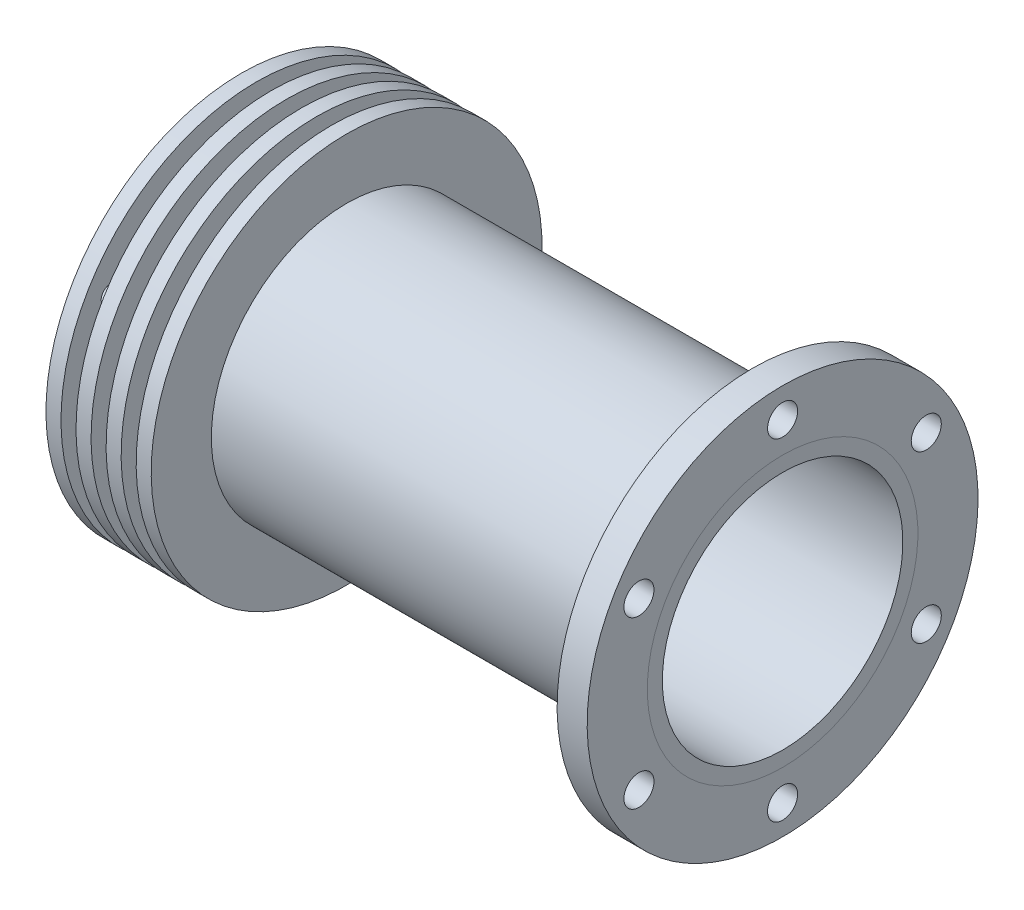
ISO-10303-21;
HEADER;
FILE_DESCRIPTION(('STEP AP214'),'2;1');
FILE_NAME('part.step','',(''),(''),'','','');
FILE_SCHEMA(('AUTOMOTIVE_DESIGN { 1 0 10303 214 1 1 1 1 }'));
ENDSEC;
DATA;
#1=APPLICATION_CONTEXT('core data for automotive mechanical design processes');
#2=APPLICATION_PROTOCOL_DEFINITION('international standard','automotive_design',2000,#1);
#3=PRODUCT_CONTEXT('',#1,'mechanical');
#4=PRODUCT('Part','Part','',(#3));
#5=PRODUCT_RELATED_PRODUCT_CATEGORY('part','',(#4));
#6=PRODUCT_DEFINITION_FORMATION('','',#4);
#7=PRODUCT_DEFINITION_CONTEXT('part definition',#1,'design');
#8=PRODUCT_DEFINITION('design','',#6,#7);
#9=PRODUCT_DEFINITION_SHAPE('','',#8);
#10=(LENGTH_UNIT() NAMED_UNIT(*) SI_UNIT(.MILLI.,.METRE.));
#11=(NAMED_UNIT(*) PLANE_ANGLE_UNIT() SI_UNIT($,.RADIAN.));
#12=(NAMED_UNIT(*) SI_UNIT($,.STERADIAN.) SOLID_ANGLE_UNIT());
#13=UNCERTAINTY_MEASURE_WITH_UNIT(LENGTH_MEASURE(1.E-05),#10,'distance_accuracy_value','');
#14=(GEOMETRIC_REPRESENTATION_CONTEXT(3) GLOBAL_UNCERTAINTY_ASSIGNED_CONTEXT((#13)) GLOBAL_UNIT_ASSIGNED_CONTEXT((#10,
#11,#12)) REPRESENTATION_CONTEXT('',''));
#15=CARTESIAN_POINT('',(0.,0.,0.));
#16=DIRECTION('',(0.,0.,1.));
#17=DIRECTION('',(1.,0.,0.));
#18=AXIS2_PLACEMENT_3D('',#15,#16,#17);
#19=CARTESIAN_POINT('',(18.0428461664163,-23.8759603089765,0.));
#20=DIRECTION('',(-1.,0.,0.));
#21=DIRECTION('',(0.,-1.,0.));
#22=AXIS2_PLACEMENT_3D('',#19,#20,#21);
#23=PLANE('',#22);
#24=CARTESIAN_POINT('',(18.0428461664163,-6.09075834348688,-30.8048734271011));
#25=DIRECTION('',(-1.,0.,0.));
#26=DIRECTION('',(0.,-0.50000000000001,0.866025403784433));
#27=AXIS2_PLACEMENT_3D('',#24,#25,#26);
#28=CIRCLE('',#27,1.9812);
#29=CARTESIAN_POINT('',(18.0428461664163,-7.0813583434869,-29.0891038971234));
#30=VERTEX_POINT('',#29);
#31=EDGE_CURVE('E256',#30,#30,#28,.T.);
#32=ORIENTED_EDGE('',*,*,#31,.F.);
#33=EDGE_LOOP('',(#32));
#34=FACE_BOUND('',#33,.T.);
#35=CARTESIAN_POINT('',(18.0428461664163,-41.6611622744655,-30.8048734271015));
#36=DIRECTION('',(-1.,0.,0.));
#37=DIRECTION('',(0.,0.499999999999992,0.866025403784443));
#38=AXIS2_PLACEMENT_3D('',#35,#36,#37);
#39=CIRCLE('',#38,1.9812);
#40=CARTESIAN_POINT('',(18.0428461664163,-40.6705622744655,-29.0891038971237));
#41=VERTEX_POINT('',#40);
#42=EDGE_CURVE('E260',#41,#41,#39,.T.);
#43=ORIENTED_EDGE('',*,*,#42,.F.);
#44=EDGE_LOOP('',(#43));
#45=FACE_BOUND('',#44,.T.);
#46=CARTESIAN_POINT('',(18.0428461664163,-59.4463642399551,0.));
#47=DIRECTION('',(-1.,0.,0.));
#48=DIRECTION('',(0.,1.,0.));
#49=AXIS2_PLACEMENT_3D('',#46,#47,#48);
#50=CIRCLE('',#49,1.9812);
#51=CARTESIAN_POINT('',(18.0428461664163,-57.4651642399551,0.));
#52=VERTEX_POINT('',#51);
#53=EDGE_CURVE('E264',#52,#52,#50,.T.);
#54=ORIENTED_EDGE('',*,*,#53,.F.);
#55=EDGE_LOOP('',(#54));
#56=FACE_BOUND('',#55,.T.);
#57=CARTESIAN_POINT('',(18.0428461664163,-41.661162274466,30.8048734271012));
#58=DIRECTION('',(-1.,0.,0.));
#59=DIRECTION('',(0.,0.500000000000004,-0.866025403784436));
#60=AXIS2_PLACEMENT_3D('',#57,#58,#59);
#61=CIRCLE('',#60,1.9812);
#62=CARTESIAN_POINT('',(18.0428461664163,-40.670562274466,29.0891038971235));
#63=VERTEX_POINT('',#62);
#64=EDGE_CURVE('E268',#63,#63,#61,.T.);
#65=ORIENTED_EDGE('',*,*,#64,.F.);
#66=EDGE_LOOP('',(#65));
#67=FACE_BOUND('',#66,.T.);
#68=CARTESIAN_POINT('',(18.0428461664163,-6.09075834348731,30.8048734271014));
#69=DIRECTION('',(-1.,0.,0.));
#70=DIRECTION('',(0.,-0.499999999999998,-0.86602540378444));
#71=AXIS2_PLACEMENT_3D('',#68,#69,#70);
#72=CIRCLE('',#71,1.9812);
#73=CARTESIAN_POINT('',(18.0428461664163,-7.08135834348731,29.0891038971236));
#74=VERTEX_POINT('',#73);
#75=EDGE_CURVE('E272',#74,#74,#72,.T.);
#76=ORIENTED_EDGE('',*,*,#75,.F.);
#77=EDGE_LOOP('',(#76));
#78=FACE_BOUND('',#77,.T.);
#79=CARTESIAN_POINT('',(18.0428461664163,11.6944436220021,0.));
#80=DIRECTION('',(-1.,0.,0.));
#81=DIRECTION('',(0.,-1.,0.));
#82=AXIS2_PLACEMENT_3D('',#79,#80,#81);
#83=CIRCLE('',#82,1.9812);
#84=CARTESIAN_POINT('',(18.0428461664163,9.71324362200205,0.));
#85=VERTEX_POINT('',#84);
#86=EDGE_CURVE('E106',#85,#85,#83,.T.);
#87=ORIENTED_EDGE('',*,*,#86,.F.);
#88=EDGE_LOOP('',(#87));
#89=FACE_BOUND('',#88,.T.);
#90=CARTESIAN_POINT('',(18.0428461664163,-23.8759603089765,0.));
#91=DIRECTION('',(-1.,0.,0.));
#92=DIRECTION('',(0.,-1.,0.));
#93=AXIS2_PLACEMENT_3D('',#90,#91,#92);
#94=CIRCLE('',#93,25.4);
#95=CARTESIAN_POINT('',(18.0428461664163,-49.2759603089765,0.));
#96=VERTEX_POINT('',#95);
#97=EDGE_CURVE('E63',#96,#96,#94,.T.);
#98=ORIENTED_EDGE('',*,*,#97,.F.);
#99=EDGE_LOOP('',(#98));
#100=FACE_BOUND('',#99,.T.);
#101=CARTESIAN_POINT('',(18.0428461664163,-23.8759603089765,0.));
#102=DIRECTION('',(1.,0.,0.));
#103=DIRECTION('',(0.,1.,0.));
#104=AXIS2_PLACEMENT_3D('',#101,#102,#103);
#105=CIRCLE('',#104,41.275);
#106=CARTESIAN_POINT('',(18.0428461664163,17.3990396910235,0.));
#107=VERTEX_POINT('',#106);
#108=EDGE_CURVE('E11',#107,#107,#105,.T.);
#109=ORIENTED_EDGE('',*,*,#108,.F.);
#110=EDGE_LOOP('',(#109));
#111=FACE_BOUND('',#110,.T.);
#112=ADVANCED_FACE('F40',(#34,#45,#56,#67,#78,#89,#100,#111),#23,.T.);
#113=CARTESIAN_POINT('',(132.342846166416,-23.8759603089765,0.));
#114=DIRECTION('',(1.,0.,0.));
#115=DIRECTION('',(0.,1.,0.));
#116=AXIS2_PLACEMENT_3D('',#113,#114,#115);
#117=CYLINDRICAL_SURFACE('',#116,41.275);
#118=ORIENTED_EDGE('',*,*,#108,.T.);
#119=EDGE_LOOP('',(#118));
#120=FACE_BOUND('',#119,.T.);
#121=CARTESIAN_POINT('',(21.2178461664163,-23.8759603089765,0.));
#122=DIRECTION('',(1.,0.,0.));
#123=DIRECTION('',(0.,1.,0.));
#124=AXIS2_PLACEMENT_3D('',#121,#122,#123);
#125=CIRCLE('',#124,41.275);
#126=CARTESIAN_POINT('',(21.2178461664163,17.3990396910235,0.));
#127=VERTEX_POINT('',#126);
#128=EDGE_CURVE('E48',#127,#127,#125,.T.);
#129=ORIENTED_EDGE('',*,*,#128,.F.);
#130=EDGE_LOOP('',(#129));
#131=FACE_BOUND('',#130,.T.);
#132=ADVANCED_FACE('F238',(#120,#131),#117,.T.);
#133=CARTESIAN_POINT('',(21.2178461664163,17.3990396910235,0.));
#134=DIRECTION('',(1.,0.,0.));
#135=DIRECTION('',(0.,1.,0.));
#136=AXIS2_PLACEMENT_3D('',#133,#134,#135);
#137=PLANE('',#136);
#138=CARTESIAN_POINT('',(21.2178461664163,-6.09075834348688,-30.8048734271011));
#139=DIRECTION('',(1.,0.,0.));
#140=DIRECTION('',(0.,1.,0.));
#141=AXIS2_PLACEMENT_3D('',#138,#139,#140);
#142=CIRCLE('',#141,1.9812);
#143=CARTESIAN_POINT('',(21.2178461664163,-4.10955834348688,-30.8048734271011));
#144=VERTEX_POINT('',#143);
#145=EDGE_CURVE('E102',#144,#144,#142,.T.);
#146=ORIENTED_EDGE('',*,*,#145,.F.);
#147=EDGE_LOOP('',(#146));
#148=FACE_BOUND('',#147,.T.);
#149=CARTESIAN_POINT('',(21.2178461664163,-41.6611622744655,-30.8048734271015));
#150=DIRECTION('',(1.,0.,0.));
#151=DIRECTION('',(0.,1.,0.));
#152=AXIS2_PLACEMENT_3D('',#149,#150,#151);
#153=CIRCLE('',#152,1.9812);
#154=CARTESIAN_POINT('',(21.2178461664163,-39.6799622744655,-30.8048734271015));
#155=VERTEX_POINT('',#154);
#156=EDGE_CURVE('E88',#155,#155,#153,.T.);
#157=ORIENTED_EDGE('',*,*,#156,.F.);
#158=EDGE_LOOP('',(#157));
#159=FACE_BOUND('',#158,.T.);
#160=CARTESIAN_POINT('',(21.2178461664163,-59.4463642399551,0.));
#161=DIRECTION('',(1.,0.,0.));
#162=DIRECTION('',(0.,1.,0.));
#163=AXIS2_PLACEMENT_3D('',#160,#161,#162);
#164=CIRCLE('',#163,1.9812);
#165=CARTESIAN_POINT('',(21.2178461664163,-57.4651642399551,0.));
#166=VERTEX_POINT('',#165);
#167=EDGE_CURVE('E84',#166,#166,#164,.T.);
#168=ORIENTED_EDGE('',*,*,#167,.F.);
#169=EDGE_LOOP('',(#168));
#170=FACE_BOUND('',#169,.T.);
#171=CARTESIAN_POINT('',(21.2178461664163,-41.661162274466,30.8048734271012));
#172=DIRECTION('',(1.,0.,0.));
#173=DIRECTION('',(0.,1.,0.));
#174=AXIS2_PLACEMENT_3D('',#171,#172,#173);
#175=CIRCLE('',#174,1.9812);
#176=CARTESIAN_POINT('',(21.2178461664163,-39.679962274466,30.8048734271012));
#177=VERTEX_POINT('',#176);
#178=EDGE_CURVE('E80',#177,#177,#175,.T.);
#179=ORIENTED_EDGE('',*,*,#178,.F.);
#180=EDGE_LOOP('',(#179));
#181=FACE_BOUND('',#180,.T.);
#182=CARTESIAN_POINT('',(21.2178461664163,-6.09075834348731,30.8048734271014));
#183=DIRECTION('',(1.,0.,0.));
#184=DIRECTION('',(0.,1.,0.));
#185=AXIS2_PLACEMENT_3D('',#182,#183,#184);
#186=CIRCLE('',#185,1.9812);
#187=CARTESIAN_POINT('',(21.2178461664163,-4.10955834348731,30.8048734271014));
#188=VERTEX_POINT('',#187);
#189=EDGE_CURVE('E74',#188,#188,#186,.T.);
#190=ORIENTED_EDGE('',*,*,#189,.F.);
#191=EDGE_LOOP('',(#190));
#192=FACE_BOUND('',#191,.T.);
#193=CARTESIAN_POINT('',(21.2178461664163,11.6944436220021,0.));
#194=DIRECTION('',(1.,0.,0.));
#195=DIRECTION('',(0.,1.,0.));
#196=AXIS2_PLACEMENT_3D('',#193,#194,#195);
#197=CIRCLE('',#196,1.9812);
#198=CARTESIAN_POINT('',(21.2178461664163,13.6756436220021,0.));
#199=VERTEX_POINT('',#198);
#200=EDGE_CURVE('E68',#199,#199,#197,.T.);
#201=ORIENTED_EDGE('',*,*,#200,.F.);
#202=EDGE_LOOP('',(#201));
#203=FACE_BOUND('',#202,.T.);
#204=ORIENTED_EDGE('',*,*,#128,.T.);
#205=EDGE_LOOP('',(#204));
#206=FACE_BOUND('',#205,.T.);
#207=CARTESIAN_POINT('',(21.2178461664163,-23.8759603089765,0.));
#208=DIRECTION('',(1.,0.,0.));
#209=DIRECTION('',(0.,1.,0.));
#210=AXIS2_PLACEMENT_3D('',#207,#208,#209);
#211=CIRCLE('',#210,28.575);
#212=CARTESIAN_POINT('',(21.2178461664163,4.69903969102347,0.));
#213=VERTEX_POINT('',#212);
#214=EDGE_CURVE('E54',#213,#213,#211,.T.);
#215=ORIENTED_EDGE('',*,*,#214,.F.);
#216=EDGE_LOOP('',(#215));
#217=FACE_BOUND('',#216,.T.);
#218=ADVANCED_FACE('F236',(#148,#159,#170,#181,#192,#203,#206,#217),#137,.T.);
#219=CARTESIAN_POINT('',(132.342846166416,-23.8759603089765,0.));
#220=DIRECTION('',(1.,0.,0.));
#221=DIRECTION('',(0.,1.,0.));
#222=AXIS2_PLACEMENT_3D('',#219,#220,#221);
#223=CYLINDRICAL_SURFACE('',#222,28.575);
#224=ORIENTED_EDGE('',*,*,#214,.T.);
#225=EDGE_LOOP('',(#224));
#226=FACE_BOUND('',#225,.T.);
#227=CARTESIAN_POINT('',(24.3928461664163,-23.8759603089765,0.));
#228=DIRECTION('',(1.,0.,0.));
#229=DIRECTION('',(0.,1.,0.));
#230=AXIS2_PLACEMENT_3D('',#227,#228,#229);
#231=CIRCLE('',#230,28.575);
#232=CARTESIAN_POINT('',(24.3928461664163,4.69903969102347,0.));
#233=VERTEX_POINT('',#232);
#234=EDGE_CURVE('E226',#233,#233,#231,.T.);
#235=ORIENTED_EDGE('',*,*,#234,.F.);
#236=EDGE_LOOP('',(#235));
#237=FACE_BOUND('',#236,.T.);
#238=ADVANCED_FACE('F233',(#226,#237),#223,.T.);
#239=CARTESIAN_POINT('',(24.3928461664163,4.69903969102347,0.));
#240=DIRECTION('',(-1.,0.,0.));
#241=DIRECTION('',(0.,-1.,0.));
#242=AXIS2_PLACEMENT_3D('',#239,#240,#241);
#243=PLANE('',#242);
#244=CARTESIAN_POINT('',(24.3928461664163,-6.09075834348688,-30.8048734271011));
#245=DIRECTION('',(-1.,0.,0.));
#246=DIRECTION('',(0.,-1.,0.));
#247=AXIS2_PLACEMENT_3D('',#244,#245,#246);
#248=CIRCLE('',#247,1.9812);
#249=CARTESIAN_POINT('',(24.3928461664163,-8.07195834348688,-30.8048734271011));
#250=VERTEX_POINT('',#249);
#251=EDGE_CURVE('E43',#250,#250,#248,.T.);
#252=ORIENTED_EDGE('',*,*,#251,.F.);
#253=EDGE_LOOP('',(#252));
#254=FACE_BOUND('',#253,.T.);
#255=CARTESIAN_POINT('',(24.3928461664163,-41.6611622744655,-30.8048734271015));
#256=DIRECTION('',(-1.,0.,0.));
#257=DIRECTION('',(0.,-1.,0.));
#258=AXIS2_PLACEMENT_3D('',#255,#256,#257);
#259=CIRCLE('',#258,1.9812);
#260=CARTESIAN_POINT('',(24.3928461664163,-43.6423622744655,-30.8048734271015));
#261=VERTEX_POINT('',#260);
#262=EDGE_CURVE('E85',#261,#261,#259,.T.);
#263=ORIENTED_EDGE('',*,*,#262,.F.);
#264=EDGE_LOOP('',(#263));
#265=FACE_BOUND('',#264,.T.);
#266=CARTESIAN_POINT('',(24.3928461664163,-59.4463642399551,0.));
#267=DIRECTION('',(-1.,0.,0.));
#268=DIRECTION('',(0.,-1.,0.));
#269=AXIS2_PLACEMENT_3D('',#266,#267,#268);
#270=CIRCLE('',#269,1.9812);
#271=CARTESIAN_POINT('',(24.3928461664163,-61.4275642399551,0.));
#272=VERTEX_POINT('',#271);
#273=EDGE_CURVE('E81',#272,#272,#270,.T.);
#274=ORIENTED_EDGE('',*,*,#273,.F.);
#275=EDGE_LOOP('',(#274));
#276=FACE_BOUND('',#275,.T.);
#277=CARTESIAN_POINT('',(24.3928461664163,-41.661162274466,30.8048734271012));
#278=DIRECTION('',(-1.,0.,0.));
#279=DIRECTION('',(0.,-1.,0.));
#280=AXIS2_PLACEMENT_3D('',#277,#278,#279);
#281=CIRCLE('',#280,1.9812);
#282=CARTESIAN_POINT('',(24.3928461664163,-43.642362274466,30.8048734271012));
#283=VERTEX_POINT('',#282);
#284=EDGE_CURVE('E76',#283,#283,#281,.T.);
#285=ORIENTED_EDGE('',*,*,#284,.F.);
#286=EDGE_LOOP('',(#285));
#287=FACE_BOUND('',#286,.T.);
#288=CARTESIAN_POINT('',(24.3928461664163,-6.09075834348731,30.8048734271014));
#289=DIRECTION('',(-1.,0.,0.));
#290=DIRECTION('',(0.,-1.,0.));
#291=AXIS2_PLACEMENT_3D('',#288,#289,#290);
#292=CIRCLE('',#291,1.9812);
#293=CARTESIAN_POINT('',(24.3928461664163,-8.07195834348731,30.8048734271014));
#294=VERTEX_POINT('',#293);
#295=EDGE_CURVE('E70',#294,#294,#292,.T.);
#296=ORIENTED_EDGE('',*,*,#295,.F.);
#297=EDGE_LOOP('',(#296));
#298=FACE_BOUND('',#297,.T.);
#299=CARTESIAN_POINT('',(24.3928461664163,11.6944436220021,0.));
#300=DIRECTION('',(-1.,0.,0.));
#301=DIRECTION('',(0.,-1.,0.));
#302=AXIS2_PLACEMENT_3D('',#299,#300,#301);
#303=CIRCLE('',#302,1.9812);
#304=CARTESIAN_POINT('',(24.3928461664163,9.71324362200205,0.));
#305=VERTEX_POINT('',#304);
#306=EDGE_CURVE('E64',#305,#305,#303,.T.);
#307=ORIENTED_EDGE('',*,*,#306,.F.);
#308=EDGE_LOOP('',(#307));
#309=FACE_BOUND('',#308,.T.);
#310=ORIENTED_EDGE('',*,*,#234,.T.);
#311=EDGE_LOOP('',(#310));
#312=FACE_BOUND('',#311,.T.);
#313=CARTESIAN_POINT('',(24.3928461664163,-23.8759603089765,0.));
#314=DIRECTION('',(1.,0.,0.));
#315=DIRECTION('',(0.,1.,0.));
#316=AXIS2_PLACEMENT_3D('',#313,#314,#315);
#317=CIRCLE('',#316,41.275);
#318=CARTESIAN_POINT('',(24.3928461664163,17.3990396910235,0.));
#319=VERTEX_POINT('',#318);
#320=EDGE_CURVE('E222',#319,#319,#317,.T.);
#321=ORIENTED_EDGE('',*,*,#320,.F.);
#322=EDGE_LOOP('',(#321));
#323=FACE_BOUND('',#322,.T.);
#324=ADVANCED_FACE('F245',(#254,#265,#276,#287,#298,#309,#312,#323),#243,.T.);
#325=CARTESIAN_POINT('',(132.342846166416,-23.8759603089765,0.));
#326=DIRECTION('',(1.,0.,0.));
#327=DIRECTION('',(0.,1.,0.));
#328=AXIS2_PLACEMENT_3D('',#325,#326,#327);
#329=CYLINDRICAL_SURFACE('',#328,41.275);
#330=ORIENTED_EDGE('',*,*,#320,.T.);
#331=EDGE_LOOP('',(#330));
#332=FACE_BOUND('',#331,.T.);
#333=CARTESIAN_POINT('',(27.5678461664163,-23.8759603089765,0.));
#334=DIRECTION('',(1.,0.,0.));
#335=DIRECTION('',(0.,1.,0.));
#336=AXIS2_PLACEMENT_3D('',#333,#334,#335);
#337=CIRCLE('',#336,41.275);
#338=CARTESIAN_POINT('',(27.5678461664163,17.3990396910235,0.));
#339=VERTEX_POINT('',#338);
#340=EDGE_CURVE('E218',#339,#339,#337,.T.);
#341=ORIENTED_EDGE('',*,*,#340,.F.);
#342=EDGE_LOOP('',(#341));
#343=FACE_BOUND('',#342,.T.);
#344=ADVANCED_FACE('F346',(#332,#343),#329,.T.);
#345=CARTESIAN_POINT('',(27.5678461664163,17.3990396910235,0.));
#346=DIRECTION('',(1.,0.,0.));
#347=DIRECTION('',(0.,1.,0.));
#348=AXIS2_PLACEMENT_3D('',#345,#346,#347);
#349=PLANE('',#348);
#350=ORIENTED_EDGE('',*,*,#340,.T.);
#351=EDGE_LOOP('',(#350));
#352=FACE_BOUND('',#351,.T.);
#353=CARTESIAN_POINT('',(27.5678461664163,-23.8759603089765,0.));
#354=DIRECTION('',(1.,0.,0.));
#355=DIRECTION('',(0.,1.,0.));
#356=AXIS2_PLACEMENT_3D('',#353,#354,#355);
#357=CIRCLE('',#356,28.575);
#358=CARTESIAN_POINT('',(27.5678461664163,4.69903969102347,0.));
#359=VERTEX_POINT('',#358);
#360=EDGE_CURVE('E214',#359,#359,#357,.T.);
#361=ORIENTED_EDGE('',*,*,#360,.F.);
#362=EDGE_LOOP('',(#361));
#363=FACE_BOUND('',#362,.T.);
#364=ADVANCED_FACE('F342',(#352,#363),#349,.T.);
#365=CARTESIAN_POINT('',(132.342846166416,-23.8759603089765,0.));
#366=DIRECTION('',(1.,0.,0.));
#367=DIRECTION('',(0.,1.,0.));
#368=AXIS2_PLACEMENT_3D('',#365,#366,#367);
#369=CYLINDRICAL_SURFACE('',#368,28.575);
#370=ORIENTED_EDGE('',*,*,#360,.T.);
#371=EDGE_LOOP('',(#370));
#372=FACE_BOUND('',#371,.T.);
#373=CARTESIAN_POINT('',(30.7428461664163,-23.8759603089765,0.));
#374=DIRECTION('',(1.,0.,0.));
#375=DIRECTION('',(0.,1.,0.));
#376=AXIS2_PLACEMENT_3D('',#373,#374,#375);
#377=CIRCLE('',#376,28.575);
#378=CARTESIAN_POINT('',(30.7428461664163,4.69903969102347,0.));
#379=VERTEX_POINT('',#378);
#380=EDGE_CURVE('E210',#379,#379,#377,.T.);
#381=ORIENTED_EDGE('',*,*,#380,.F.);
#382=EDGE_LOOP('',(#381));
#383=FACE_BOUND('',#382,.T.);
#384=ADVANCED_FACE('F338',(#372,#383),#369,.T.);
#385=CARTESIAN_POINT('',(30.7428461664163,4.69903969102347,0.));
#386=DIRECTION('',(-1.,0.,0.));
#387=DIRECTION('',(0.,-1.,0.));
#388=AXIS2_PLACEMENT_3D('',#385,#386,#387);
#389=PLANE('',#388);
#390=ORIENTED_EDGE('',*,*,#380,.T.);
#391=EDGE_LOOP('',(#390));
#392=FACE_BOUND('',#391,.T.);
#393=CARTESIAN_POINT('',(30.7428461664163,-23.8759603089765,0.));
#394=DIRECTION('',(1.,0.,0.));
#395=DIRECTION('',(0.,1.,0.));
#396=AXIS2_PLACEMENT_3D('',#393,#394,#395);
#397=CIRCLE('',#396,41.275);
#398=CARTESIAN_POINT('',(30.7428461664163,17.3990396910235,0.));
#399=VERTEX_POINT('',#398);
#400=EDGE_CURVE('E206',#399,#399,#397,.T.);
#401=ORIENTED_EDGE('',*,*,#400,.F.);
#402=EDGE_LOOP('',(#401));
#403=FACE_BOUND('',#402,.T.);
#404=ADVANCED_FACE('F334',(#392,#403),#389,.T.);
#405=CARTESIAN_POINT('',(132.342846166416,-23.8759603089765,0.));
#406=DIRECTION('',(1.,0.,0.));
#407=DIRECTION('',(0.,1.,0.));
#408=AXIS2_PLACEMENT_3D('',#405,#406,#407);
#409=CYLINDRICAL_SURFACE('',#408,41.275);
#410=ORIENTED_EDGE('',*,*,#400,.T.);
#411=EDGE_LOOP('',(#410));
#412=FACE_BOUND('',#411,.T.);
#413=CARTESIAN_POINT('',(33.9178461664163,-23.8759603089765,0.));
#414=DIRECTION('',(1.,0.,0.));
#415=DIRECTION('',(0.,1.,0.));
#416=AXIS2_PLACEMENT_3D('',#413,#414,#415);
#417=CIRCLE('',#416,41.275);
#418=CARTESIAN_POINT('',(33.9178461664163,17.3990396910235,0.));
#419=VERTEX_POINT('',#418);
#420=EDGE_CURVE('E202',#419,#419,#417,.T.);
#421=ORIENTED_EDGE('',*,*,#420,.F.);
#422=EDGE_LOOP('',(#421));
#423=FACE_BOUND('',#422,.T.);
#424=ADVANCED_FACE('F330',(#412,#423),#409,.T.);
#425=CARTESIAN_POINT('',(33.9178461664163,17.3990396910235,0.));
#426=DIRECTION('',(1.,0.,0.));
#427=DIRECTION('',(0.,1.,0.));
#428=AXIS2_PLACEMENT_3D('',#425,#426,#427);
#429=PLANE('',#428);
#430=ORIENTED_EDGE('',*,*,#420,.T.);
#431=EDGE_LOOP('',(#430));
#432=FACE_BOUND('',#431,.T.);
#433=CARTESIAN_POINT('',(33.9178461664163,-23.8759603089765,0.));
#434=DIRECTION('',(1.,0.,0.));
#435=DIRECTION('',(0.,1.,0.));
#436=AXIS2_PLACEMENT_3D('',#433,#434,#435);
#437=CIRCLE('',#436,28.575);
#438=CARTESIAN_POINT('',(33.9178461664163,4.69903969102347,0.));
#439=VERTEX_POINT('',#438);
#440=EDGE_CURVE('E198',#439,#439,#437,.T.);
#441=ORIENTED_EDGE('',*,*,#440,.F.);
#442=EDGE_LOOP('',(#441));
#443=FACE_BOUND('',#442,.T.);
#444=ADVANCED_FACE('F326',(#432,#443),#429,.T.);
#445=CARTESIAN_POINT('',(132.342846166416,-23.8759603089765,0.));
#446=DIRECTION('',(1.,0.,0.));
#447=DIRECTION('',(0.,1.,0.));
#448=AXIS2_PLACEMENT_3D('',#445,#446,#447);
#449=CYLINDRICAL_SURFACE('',#448,28.575);
#450=ORIENTED_EDGE('',*,*,#440,.T.);
#451=EDGE_LOOP('',(#450));
#452=FACE_BOUND('',#451,.T.);
#453=CARTESIAN_POINT('',(37.0928461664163,-23.8759603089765,0.));
#454=DIRECTION('',(1.,0.,0.));
#455=DIRECTION('',(0.,1.,0.));
#456=AXIS2_PLACEMENT_3D('',#453,#454,#455);
#457=CIRCLE('',#456,28.575);
#458=CARTESIAN_POINT('',(37.0928461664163,4.69903969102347,0.));
#459=VERTEX_POINT('',#458);
#460=EDGE_CURVE('E194',#459,#459,#457,.T.);
#461=ORIENTED_EDGE('',*,*,#460,.F.);
#462=EDGE_LOOP('',(#461));
#463=FACE_BOUND('',#462,.T.);
#464=ADVANCED_FACE('F322',(#452,#463),#449,.T.);
#465=CARTESIAN_POINT('',(37.0928461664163,4.69903969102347,0.));
#466=DIRECTION('',(-1.,0.,0.));
#467=DIRECTION('',(0.,-1.,0.));
#468=AXIS2_PLACEMENT_3D('',#465,#466,#467);
#469=PLANE('',#468);
#470=ORIENTED_EDGE('',*,*,#460,.T.);
#471=EDGE_LOOP('',(#470));
#472=FACE_BOUND('',#471,.T.);
#473=CARTESIAN_POINT('',(37.0928461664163,-23.8759603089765,0.));
#474=DIRECTION('',(1.,0.,0.));
#475=DIRECTION('',(0.,1.,0.));
#476=AXIS2_PLACEMENT_3D('',#473,#474,#475);
#477=CIRCLE('',#476,41.275);
#478=CARTESIAN_POINT('',(37.0928461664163,17.3990396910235,0.));
#479=VERTEX_POINT('',#478);
#480=EDGE_CURVE('E190',#479,#479,#477,.T.);
#481=ORIENTED_EDGE('',*,*,#480,.F.);
#482=EDGE_LOOP('',(#481));
#483=FACE_BOUND('',#482,.T.);
#484=ADVANCED_FACE('F318',(#472,#483),#469,.T.);
#485=CARTESIAN_POINT('',(132.342846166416,-23.8759603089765,0.));
#486=DIRECTION('',(1.,0.,0.));
#487=DIRECTION('',(0.,1.,0.));
#488=AXIS2_PLACEMENT_3D('',#485,#486,#487);
#489=CYLINDRICAL_SURFACE('',#488,41.275);
#490=ORIENTED_EDGE('',*,*,#480,.T.);
#491=EDGE_LOOP('',(#490));
#492=FACE_BOUND('',#491,.T.);
#493=CARTESIAN_POINT('',(40.2678461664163,-23.8759603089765,0.));
#494=DIRECTION('',(1.,0.,0.));
#495=DIRECTION('',(0.,1.,0.));
#496=AXIS2_PLACEMENT_3D('',#493,#494,#495);
#497=CIRCLE('',#496,41.275);
#498=CARTESIAN_POINT('',(40.2678461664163,17.3990396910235,0.));
#499=VERTEX_POINT('',#498);
#500=EDGE_CURVE('E186',#499,#499,#497,.T.);
#501=ORIENTED_EDGE('',*,*,#500,.F.);
#502=EDGE_LOOP('',(#501));
#503=FACE_BOUND('',#502,.T.);
#504=ADVANCED_FACE('F314',(#492,#503),#489,.T.);
#505=CARTESIAN_POINT('',(40.2678461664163,17.3990396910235,0.));
#506=DIRECTION('',(1.,0.,0.));
#507=DIRECTION('',(0.,1.,0.));
#508=AXIS2_PLACEMENT_3D('',#505,#506,#507);
#509=PLANE('',#508);
#510=ORIENTED_EDGE('',*,*,#500,.T.);
#511=EDGE_LOOP('',(#510));
#512=FACE_BOUND('',#511,.T.);
#513=CARTESIAN_POINT('',(40.2678461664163,-23.8759603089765,0.));
#514=DIRECTION('',(1.,0.,0.));
#515=DIRECTION('',(0.,1.,0.));
#516=AXIS2_PLACEMENT_3D('',#513,#514,#515);
#517=CIRCLE('',#516,28.575);
#518=CARTESIAN_POINT('',(40.2678461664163,4.69903969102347,0.));
#519=VERTEX_POINT('',#518);
#520=EDGE_CURVE('E182',#519,#519,#517,.T.);
#521=ORIENTED_EDGE('',*,*,#520,.F.);
#522=EDGE_LOOP('',(#521));
#523=FACE_BOUND('',#522,.T.);
#524=ADVANCED_FACE('F310',(#512,#523),#509,.T.);
#525=CARTESIAN_POINT('',(132.342846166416,-23.8759603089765,0.));
#526=DIRECTION('',(1.,0.,0.));
#527=DIRECTION('',(0.,1.,0.));
#528=AXIS2_PLACEMENT_3D('',#525,#526,#527);
#529=CYLINDRICAL_SURFACE('',#528,28.575);
#530=ORIENTED_EDGE('',*,*,#520,.T.);
#531=EDGE_LOOP('',(#530));
#532=FACE_BOUND('',#531,.T.);
#533=CARTESIAN_POINT('',(125.992814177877,-23.8759603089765,0.));
#534=DIRECTION('',(1.,0.,0.));
#535=DIRECTION('',(0.,1.,0.));
#536=AXIS2_PLACEMENT_3D('',#533,#534,#535);
#537=CIRCLE('',#536,28.575);
#538=CARTESIAN_POINT('',(125.992814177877,4.69903969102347,0.));
#539=VERTEX_POINT('',#538);
#540=EDGE_CURVE('E178',#539,#539,#537,.T.);
#541=ORIENTED_EDGE('',*,*,#540,.F.);
#542=EDGE_LOOP('',(#541));
#543=FACE_BOUND('',#542,.T.);
#544=ADVANCED_FACE('F306',(#532,#543),#529,.T.);
#545=CARTESIAN_POINT('',(125.992814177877,4.69903969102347,0.));
#546=DIRECTION('',(-1.,0.,0.));
#547=DIRECTION('',(0.,-1.,0.));
#548=AXIS2_PLACEMENT_3D('',#545,#546,#547);
#549=PLANE('',#548);
#550=CARTESIAN_POINT('',(125.992814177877,-6.35848509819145,-30.3411570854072));
#551=DIRECTION('',(1.,0.,0.));
#552=DIRECTION('',(0.,0.50000000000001,-0.866025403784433));
#553=AXIS2_PLACEMENT_3D('',#550,#551,#552);
#554=CIRCLE('',#553,3.175);
#555=CARTESIAN_POINT('',(125.992814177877,-4.77098509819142,-33.0907877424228));
#556=VERTEX_POINT('',#555);
#557=EDGE_CURVE('E142',#556,#556,#554,.T.);
#558=ORIENTED_EDGE('',*,*,#557,.T.);
#559=EDGE_LOOP('',(#558));
#560=FACE_BOUND('',#559,.T.);
#561=CARTESIAN_POINT('',(125.992814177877,-41.3934355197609,-30.3411570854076));
#562=DIRECTION('',(1.,0.,0.));
#563=DIRECTION('',(0.,-0.499999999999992,-0.866025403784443));
#564=AXIS2_PLACEMENT_3D('',#561,#562,#563);
#565=CIRCLE('',#564,3.175);
#566=CARTESIAN_POINT('',(125.992814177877,-42.9809355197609,-33.0907877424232));
#567=VERTEX_POINT('',#566);
#568=EDGE_CURVE('E134',#567,#567,#565,.T.);
#569=ORIENTED_EDGE('',*,*,#568,.T.);
#570=EDGE_LOOP('',(#569));
#571=FACE_BOUND('',#570,.T.);
#572=CARTESIAN_POINT('',(125.992814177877,-58.9109107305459,0.));
#573=DIRECTION('',(1.,0.,0.));
#574=DIRECTION('',(0.,-1.,0.));
#575=AXIS2_PLACEMENT_3D('',#572,#573,#574);
#576=CIRCLE('',#575,3.175);
#577=CARTESIAN_POINT('',(125.992814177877,-62.0859107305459,0.));
#578=VERTEX_POINT('',#577);
#579=EDGE_CURVE('E126',#578,#578,#576,.T.);
#580=ORIENTED_EDGE('',*,*,#579,.T.);
#581=EDGE_LOOP('',(#580));
#582=FACE_BOUND('',#581,.T.);
#583=CARTESIAN_POINT('',(125.992814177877,-41.3934355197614,30.3411570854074));
#584=DIRECTION('',(1.,0.,0.));
#585=DIRECTION('',(0.,-0.500000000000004,0.866025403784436));
#586=AXIS2_PLACEMENT_3D('',#583,#584,#585);
#587=CIRCLE('',#586,3.175);
#588=CARTESIAN_POINT('',(125.992814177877,-42.9809355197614,33.090787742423));
#589=VERTEX_POINT('',#588);
#590=EDGE_CURVE('E117',#589,#589,#587,.T.);
#591=ORIENTED_EDGE('',*,*,#590,.T.);
#592=EDGE_LOOP('',(#591));
#593=FACE_BOUND('',#592,.T.);
#594=CARTESIAN_POINT('',(125.992814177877,-6.35848509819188,30.3411570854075));
#595=DIRECTION('',(1.,0.,0.));
#596=DIRECTION('',(0.,0.499999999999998,0.86602540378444));
#597=AXIS2_PLACEMENT_3D('',#594,#595,#596);
#598=CIRCLE('',#597,3.175);
#599=CARTESIAN_POINT('',(125.992814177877,-4.77098509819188,33.0907877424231));
#600=VERTEX_POINT('',#599);
#601=EDGE_CURVE('E149',#600,#600,#598,.T.);
#602=ORIENTED_EDGE('',*,*,#601,.T.);
#603=EDGE_LOOP('',(#602));
#604=FACE_BOUND('',#603,.T.);
#605=CARTESIAN_POINT('',(125.992814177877,11.1589901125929,0.));
#606=DIRECTION('',(1.,0.,0.));
#607=DIRECTION('',(0.,1.,0.));
#608=AXIS2_PLACEMENT_3D('',#605,#606,#607);
#609=CIRCLE('',#608,3.175);
#610=CARTESIAN_POINT('',(125.992814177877,14.3339901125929,0.));
#611=VERTEX_POINT('',#610);
#612=EDGE_CURVE('E157',#611,#611,#609,.T.);
#613=ORIENTED_EDGE('',*,*,#612,.T.);
#614=EDGE_LOOP('',(#613));
#615=FACE_BOUND('',#614,.T.);
#616=ORIENTED_EDGE('',*,*,#540,.T.);
#617=EDGE_LOOP('',(#616));
#618=FACE_BOUND('',#617,.T.);
#619=CARTESIAN_POINT('',(125.992814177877,-23.8759603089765,0.));
#620=DIRECTION('',(1.,0.,0.));
#621=DIRECTION('',(0.,1.,0.));
#622=AXIS2_PLACEMENT_3D('',#619,#620,#621);
#623=CIRCLE('',#622,41.275);
#624=CARTESIAN_POINT('',(125.992814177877,17.3990396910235,0.));
#625=VERTEX_POINT('',#624);
#626=EDGE_CURVE('E174',#625,#625,#623,.T.);
#627=ORIENTED_EDGE('',*,*,#626,.F.);
#628=EDGE_LOOP('',(#627));
#629=FACE_BOUND('',#628,.T.);
#630=ADVANCED_FACE('F302',(#560,#571,#582,#593,#604,#615,#618,#629),#549,.T.);
#631=CARTESIAN_POINT('',(132.342846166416,-23.8759603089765,0.));
#632=DIRECTION('',(1.,0.,0.));
#633=DIRECTION('',(0.,1.,0.));
#634=AXIS2_PLACEMENT_3D('',#631,#632,#633);
#635=CYLINDRICAL_SURFACE('',#634,41.275);
#636=ORIENTED_EDGE('',*,*,#626,.T.);
#637=EDGE_LOOP('',(#636));
#638=FACE_BOUND('',#637,.T.);
#639=CARTESIAN_POINT('',(132.342814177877,-23.8759603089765,0.));
#640=DIRECTION('',(1.,0.,0.));
#641=DIRECTION('',(0.,1.,0.));
#642=AXIS2_PLACEMENT_3D('',#639,#640,#641);
#643=CIRCLE('',#642,41.275);
#644=CARTESIAN_POINT('',(132.342814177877,17.3990396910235,0.));
#645=VERTEX_POINT('',#644);
#646=EDGE_CURVE('E170',#645,#645,#643,.T.);
#647=ORIENTED_EDGE('',*,*,#646,.F.);
#648=EDGE_LOOP('',(#647));
#649=FACE_BOUND('',#648,.T.);
#650=ADVANCED_FACE('F298',(#638,#649),#635,.T.);
#651=CARTESIAN_POINT('',(132.342814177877,17.3990396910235,0.));
#652=DIRECTION('',(1.,0.,0.));
#653=DIRECTION('',(0.,1.,0.));
#654=AXIS2_PLACEMENT_3D('',#651,#652,#653);
#655=PLANE('',#654);
#656=CARTESIAN_POINT('',(132.342814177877,-6.35848509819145,-30.3411570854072));
#657=DIRECTION('',(1.,0.,0.));
#658=DIRECTION('',(0.,0.50000000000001,-0.866025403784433));
#659=AXIS2_PLACEMENT_3D('',#656,#657,#658);
#660=CIRCLE('',#659,3.175);
#661=CARTESIAN_POINT('',(132.342814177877,-4.77098509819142,-33.0907877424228));
#662=VERTEX_POINT('',#661);
#663=EDGE_CURVE('E116',#662,#662,#660,.T.);
#664=ORIENTED_EDGE('',*,*,#663,.F.);
#665=EDGE_LOOP('',(#664));
#666=FACE_BOUND('',#665,.T.);
#667=CARTESIAN_POINT('',(132.342814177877,-41.3934355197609,-30.3411570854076));
#668=DIRECTION('',(1.,0.,0.));
#669=DIRECTION('',(0.,-0.499999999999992,-0.866025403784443));
#670=AXIS2_PLACEMENT_3D('',#667,#668,#669);
#671=CIRCLE('',#670,3.175);
#672=CARTESIAN_POINT('',(132.342814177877,-42.9809355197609,-33.0907877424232));
#673=VERTEX_POINT('',#672);
#674=EDGE_CURVE('E138',#673,#673,#671,.T.);
#675=ORIENTED_EDGE('',*,*,#674,.F.);
#676=EDGE_LOOP('',(#675));
#677=FACE_BOUND('',#676,.T.);
#678=CARTESIAN_POINT('',(132.342814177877,-58.9109107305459,0.));
#679=DIRECTION('',(1.,0.,0.));
#680=DIRECTION('',(0.,-1.,0.));
#681=AXIS2_PLACEMENT_3D('',#678,#679,#680);
#682=CIRCLE('',#681,3.175);
#683=CARTESIAN_POINT('',(132.342814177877,-62.0859107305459,0.));
#684=VERTEX_POINT('',#683);
#685=EDGE_CURVE('E130',#684,#684,#682,.T.);
#686=ORIENTED_EDGE('',*,*,#685,.F.);
#687=EDGE_LOOP('',(#686));
#688=FACE_BOUND('',#687,.T.);
#689=CARTESIAN_POINT('',(132.342814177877,-41.3934355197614,30.3411570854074));
#690=DIRECTION('',(1.,0.,0.));
#691=DIRECTION('',(0.,-0.500000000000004,0.866025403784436));
#692=AXIS2_PLACEMENT_3D('',#689,#690,#691);
#693=CIRCLE('',#692,3.175);
#694=CARTESIAN_POINT('',(132.342814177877,-42.9809355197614,33.090787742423));
#695=VERTEX_POINT('',#694);
#696=EDGE_CURVE('E122',#695,#695,#693,.T.);
#697=ORIENTED_EDGE('',*,*,#696,.F.);
#698=EDGE_LOOP('',(#697));
#699=FACE_BOUND('',#698,.T.);
#700=CARTESIAN_POINT('',(132.342814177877,-6.35848509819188,30.3411570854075));
#701=DIRECTION('',(1.,0.,0.));
#702=DIRECTION('',(0.,0.499999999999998,0.86602540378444));
#703=AXIS2_PLACEMENT_3D('',#700,#701,#702);
#704=CIRCLE('',#703,3.175);
#705=CARTESIAN_POINT('',(132.342814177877,-4.77098509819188,33.0907877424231));
#706=VERTEX_POINT('',#705);
#707=EDGE_CURVE('E121',#706,#706,#704,.T.);
#708=ORIENTED_EDGE('',*,*,#707,.F.);
#709=EDGE_LOOP('',(#708));
#710=FACE_BOUND('',#709,.T.);
#711=CARTESIAN_POINT('',(132.342814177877,11.1589901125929,0.));
#712=DIRECTION('',(1.,0.,0.));
#713=DIRECTION('',(0.,1.,0.));
#714=AXIS2_PLACEMENT_3D('',#711,#712,#713);
#715=CIRCLE('',#714,3.175);
#716=CARTESIAN_POINT('',(132.342814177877,14.3339901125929,0.));
#717=VERTEX_POINT('',#716);
#718=EDGE_CURVE('E153',#717,#717,#715,.T.);
#719=ORIENTED_EDGE('',*,*,#718,.F.);
#720=EDGE_LOOP('',(#719));
#721=FACE_BOUND('',#720,.T.);
#722=ORIENTED_EDGE('',*,*,#646,.T.);
#723=EDGE_LOOP('',(#722));
#724=FACE_BOUND('',#723,.T.);
#725=CARTESIAN_POINT('',(132.342814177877,-23.8759603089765,0.));
#726=DIRECTION('',(1.,0.,0.));
#727=DIRECTION('',(0.,1.,0.));
#728=AXIS2_PLACEMENT_3D('',#725,#726,#727);
#729=CIRCLE('',#728,28.575);
#730=CARTESIAN_POINT('',(132.342814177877,4.69903969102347,0.));
#731=VERTEX_POINT('',#730);
#732=EDGE_CURVE('E62',#731,#731,#729,.T.);
#733=ORIENTED_EDGE('',*,*,#732,.F.);
#734=EDGE_LOOP('',(#733));
#735=FACE_BOUND('',#734,.T.);
#736=ADVANCED_FACE('F291',(#666,#677,#688,#699,#710,#721,#724,#735),#655,.T.);
#737=CARTESIAN_POINT('',(132.342846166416,-23.8759603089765,0.));
#738=DIRECTION('',(-1.,0.,0.));
#739=DIRECTION('',(0.,-1.,0.));
#740=AXIS2_PLACEMENT_3D('',#737,#738,#739);
#741=CONICAL_SURFACE('',#740,0.,1.57079520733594);
#742=CARTESIAN_POINT('',(132.342817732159,-23.8759603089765,0.));
#743=DIRECTION('',(-1.,0.,0.));
#744=DIRECTION('',(0.,-1.,0.));
#745=AXIS2_PLACEMENT_3D('',#742,#743,#744);
#746=CIRCLE('',#745,25.4);
#747=CARTESIAN_POINT('',(132.342817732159,-49.2759603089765,0.));
#748=VERTEX_POINT('',#747);
#749=EDGE_CURVE('E58',#748,#748,#746,.F.);
#750=ORIENTED_EDGE('',*,*,#749,.F.);
#751=EDGE_LOOP('',(#750));
#752=FACE_BOUND('',#751,.T.);
#753=ORIENTED_EDGE('',*,*,#732,.T.);
#754=EDGE_LOOP('',(#753));
#755=FACE_BOUND('',#754,.T.);
#756=ADVANCED_FACE('F281',(#752,#755),#741,.T.);
#757=CARTESIAN_POINT('',(132.342831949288,-23.8759603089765,0.));
#758=DIRECTION('',(-1.,0.,0.));
#759=DIRECTION('',(0.,-1.,0.));
#760=AXIS2_PLACEMENT_3D('',#757,#758,#759);
#761=CYLINDRICAL_SURFACE('',#760,25.4);
#762=ORIENTED_EDGE('',*,*,#749,.T.);
#763=EDGE_LOOP('',(#762));
#764=FACE_BOUND('',#763,.T.);
#765=ORIENTED_EDGE('',*,*,#97,.T.);
#766=EDGE_LOOP('',(#765));
#767=FACE_BOUND('',#766,.T.);
#768=ADVANCED_FACE('F278',(#764,#767),#761,.F.);
#769=CARTESIAN_POINT('',(125.992814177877,11.1589901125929,0.));
#770=DIRECTION('',(1.,0.,0.));
#771=DIRECTION('',(0.,1.,0.));
#772=AXIS2_PLACEMENT_3D('',#769,#770,#771);
#773=CYLINDRICAL_SURFACE('',#772,3.175);
#774=ORIENTED_EDGE('',*,*,#612,.F.);
#775=EDGE_LOOP('',(#774));
#776=FACE_BOUND('',#775,.T.);
#777=ORIENTED_EDGE('',*,*,#718,.T.);
#778=EDGE_LOOP('',(#777));
#779=FACE_BOUND('',#778,.T.);
#780=ADVANCED_FACE('F280',(#776,#779),#773,.F.);
#781=CARTESIAN_POINT('',(125.992814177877,-6.35848509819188,30.3411570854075));
#782=DIRECTION('',(1.,0.,0.));
#783=DIRECTION('',(0.,1.,0.));
#784=AXIS2_PLACEMENT_3D('',#781,#782,#783);
#785=CYLINDRICAL_SURFACE('',#784,3.175);
#786=ORIENTED_EDGE('',*,*,#601,.F.);
#787=EDGE_LOOP('',(#786));
#788=FACE_BOUND('',#787,.T.);
#789=ORIENTED_EDGE('',*,*,#707,.T.);
#790=EDGE_LOOP('',(#789));
#791=FACE_BOUND('',#790,.T.);
#792=ADVANCED_FACE('F288',(#788,#791),#785,.F.);
#793=CARTESIAN_POINT('',(125.992814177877,-41.3934355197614,30.3411570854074));
#794=DIRECTION('',(1.,0.,0.));
#795=DIRECTION('',(0.,1.,0.));
#796=AXIS2_PLACEMENT_3D('',#793,#794,#795);
#797=CYLINDRICAL_SURFACE('',#796,3.175);
#798=ORIENTED_EDGE('',*,*,#590,.F.);
#799=EDGE_LOOP('',(#798));
#800=FACE_BOUND('',#799,.T.);
#801=ORIENTED_EDGE('',*,*,#696,.T.);
#802=EDGE_LOOP('',(#801));
#803=FACE_BOUND('',#802,.T.);
#804=ADVANCED_FACE('F423',(#800,#803),#797,.F.);
#805=CARTESIAN_POINT('',(125.992814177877,-58.9109107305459,0.));
#806=DIRECTION('',(1.,0.,0.));
#807=DIRECTION('',(0.,1.,0.));
#808=AXIS2_PLACEMENT_3D('',#805,#806,#807);
#809=CYLINDRICAL_SURFACE('',#808,3.175);
#810=ORIENTED_EDGE('',*,*,#579,.F.);
#811=EDGE_LOOP('',(#810));
#812=FACE_BOUND('',#811,.T.);
#813=ORIENTED_EDGE('',*,*,#685,.T.);
#814=EDGE_LOOP('',(#813));
#815=FACE_BOUND('',#814,.T.);
#816=ADVANCED_FACE('F426',(#812,#815),#809,.F.);
#817=CARTESIAN_POINT('',(125.992814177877,-41.3934355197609,-30.3411570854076));
#818=DIRECTION('',(1.,0.,0.));
#819=DIRECTION('',(0.,1.,0.));
#820=AXIS2_PLACEMENT_3D('',#817,#818,#819);
#821=CYLINDRICAL_SURFACE('',#820,3.175);
#822=ORIENTED_EDGE('',*,*,#568,.F.);
#823=EDGE_LOOP('',(#822));
#824=FACE_BOUND('',#823,.T.);
#825=ORIENTED_EDGE('',*,*,#674,.T.);
#826=EDGE_LOOP('',(#825));
#827=FACE_BOUND('',#826,.T.);
#828=ADVANCED_FACE('F416',(#824,#827),#821,.F.);
#829=CARTESIAN_POINT('',(125.992814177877,-6.35848509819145,-30.3411570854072));
#830=DIRECTION('',(1.,0.,0.));
#831=DIRECTION('',(0.,1.,0.));
#832=AXIS2_PLACEMENT_3D('',#829,#830,#831);
#833=CYLINDRICAL_SURFACE('',#832,3.175);
#834=ORIENTED_EDGE('',*,*,#557,.F.);
#835=EDGE_LOOP('',(#834));
#836=FACE_BOUND('',#835,.T.);
#837=ORIENTED_EDGE('',*,*,#663,.T.);
#838=EDGE_LOOP('',(#837));
#839=FACE_BOUND('',#838,.T.);
#840=ADVANCED_FACE('F411',(#836,#839),#833,.F.);
#841=CARTESIAN_POINT('',(24.6468461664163,11.6944436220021,0.));
#842=DIRECTION('',(-1.,0.,0.));
#843=DIRECTION('',(0.,-1.,0.));
#844=AXIS2_PLACEMENT_3D('',#841,#842,#843);
#845=PLANE('',#844);
#846=CARTESIAN_POINT('',(24.6468461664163,11.6944436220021,0.));
#847=DIRECTION('',(-1.,0.,0.));
#848=DIRECTION('',(0.,-1.,0.));
#849=AXIS2_PLACEMENT_3D('',#846,#847,#848);
#850=CIRCLE('',#849,1.9812);
#851=CARTESIAN_POINT('',(24.6468461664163,9.71324362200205,0.));
#852=VERTEX_POINT('',#851);
#853=EDGE_CURVE('E69',#852,#852,#850,.T.);
#854=ORIENTED_EDGE('',*,*,#853,.T.);
#855=EDGE_LOOP('',(#854));
#856=FACE_BOUND('',#855,.T.);
#857=ADVANCED_FACE('F406',(#856),#845,.T.);
#858=CARTESIAN_POINT('',(24.6468461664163,11.6944436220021,0.));
#859=DIRECTION('',(-1.,0.,0.));
#860=DIRECTION('',(0.,-1.,0.));
#861=AXIS2_PLACEMENT_3D('',#858,#859,#860);
#862=CYLINDRICAL_SURFACE('',#861,1.9812);
#863=ORIENTED_EDGE('',*,*,#306,.T.);
#864=EDGE_LOOP('',(#863));
#865=FACE_BOUND('',#864,.T.);
#866=ORIENTED_EDGE('',*,*,#853,.F.);
#867=EDGE_LOOP('',(#866));
#868=FACE_BOUND('',#867,.T.);
#869=ADVANCED_FACE('F402',(#865,#868),#862,.F.);
#870=ORIENTED_EDGE('',*,*,#200,.T.);
#871=EDGE_LOOP('',(#870));
#872=FACE_BOUND('',#871,.T.);
#873=ORIENTED_EDGE('',*,*,#86,.T.);
#874=EDGE_LOOP('',(#873));
#875=FACE_BOUND('',#874,.T.);
#876=ADVANCED_FACE('F405',(#872,#875),#862,.F.);
#877=CARTESIAN_POINT('',(24.6468461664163,-6.09075834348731,30.8048734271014));
#878=DIRECTION('',(-1.,0.,0.));
#879=DIRECTION('',(0.,-0.499999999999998,-0.86602540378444));
#880=AXIS2_PLACEMENT_3D('',#877,#878,#879);
#881=PLANE('',#880);
#882=CARTESIAN_POINT('',(24.6468461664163,-6.09075834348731,30.8048734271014));
#883=DIRECTION('',(-1.,0.,0.));
#884=DIRECTION('',(0.,-0.499999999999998,-0.86602540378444));
#885=AXIS2_PLACEMENT_3D('',#882,#883,#884);
#886=CIRCLE('',#885,1.9812);
#887=CARTESIAN_POINT('',(24.6468461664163,-7.08135834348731,29.0891038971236));
#888=VERTEX_POINT('',#887);
#889=EDGE_CURVE('E75',#888,#888,#886,.T.);
#890=ORIENTED_EDGE('',*,*,#889,.T.);
#891=EDGE_LOOP('',(#890));
#892=FACE_BOUND('',#891,.T.);
#893=ADVANCED_FACE('F484',(#892),#881,.T.);
#894=CARTESIAN_POINT('',(24.6468461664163,-6.09075834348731,30.8048734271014));
#895=DIRECTION('',(-1.,0.,0.));
#896=DIRECTION('',(0.,-1.,0.));
#897=AXIS2_PLACEMENT_3D('',#894,#895,#896);
#898=CYLINDRICAL_SURFACE('',#897,1.9812);
#899=ORIENTED_EDGE('',*,*,#295,.T.);
#900=EDGE_LOOP('',(#899));
#901=FACE_BOUND('',#900,.T.);
#902=ORIENTED_EDGE('',*,*,#889,.F.);
#903=EDGE_LOOP('',(#902));
#904=FACE_BOUND('',#903,.T.);
#905=ADVANCED_FACE('F420',(#901,#904),#898,.F.);
#906=CARTESIAN_POINT('',(24.6468461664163,-41.661162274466,30.8048734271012));
#907=DIRECTION('',(-1.,0.,0.));
#908=DIRECTION('',(0.,0.500000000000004,-0.866025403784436));
#909=AXIS2_PLACEMENT_3D('',#906,#907,#908);
#910=PLANE('',#909);
#911=CARTESIAN_POINT('',(24.6468461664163,-41.661162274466,30.8048734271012));
#912=DIRECTION('',(-1.,0.,0.));
#913=DIRECTION('',(0.,0.500000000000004,-0.866025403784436));
#914=AXIS2_PLACEMENT_3D('',#911,#912,#913);
#915=CIRCLE('',#914,1.9812);
#916=CARTESIAN_POINT('',(24.6468461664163,-40.670562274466,29.0891038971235));
#917=VERTEX_POINT('',#916);
#918=EDGE_CURVE('E656',#917,#917,#915,.T.);
#919=ORIENTED_EDGE('',*,*,#918,.T.);
#920=EDGE_LOOP('',(#919));
#921=FACE_BOUND('',#920,.T.);
#922=ADVANCED_FACE('F517',(#921),#910,.T.);
#923=CARTESIAN_POINT('',(24.6468461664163,-41.661162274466,30.8048734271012));
#924=DIRECTION('',(-1.,0.,0.));
#925=DIRECTION('',(0.,-1.,0.));
#926=AXIS2_PLACEMENT_3D('',#923,#924,#925);
#927=CYLINDRICAL_SURFACE('',#926,1.9812);
#928=ORIENTED_EDGE('',*,*,#284,.T.);
#929=EDGE_LOOP('',(#928));
#930=FACE_BOUND('',#929,.T.);
#931=ORIENTED_EDGE('',*,*,#918,.F.);
#932=EDGE_LOOP('',(#931));
#933=FACE_BOUND('',#932,.T.);
#934=ADVANCED_FACE('F527',(#930,#933),#927,.F.);
#935=CARTESIAN_POINT('',(24.6468461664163,-59.4463642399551,0.));
#936=DIRECTION('',(-1.,0.,0.));
#937=DIRECTION('',(0.,1.,0.));
#938=AXIS2_PLACEMENT_3D('',#935,#936,#937);
#939=PLANE('',#938);
#940=CARTESIAN_POINT('',(24.6468461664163,-59.4463642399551,0.));
#941=DIRECTION('',(-1.,0.,0.));
#942=DIRECTION('',(0.,1.,0.));
#943=AXIS2_PLACEMENT_3D('',#940,#941,#942);
#944=CIRCLE('',#943,1.9812);
#945=CARTESIAN_POINT('',(24.6468461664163,-57.4651642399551,0.));
#946=VERTEX_POINT('',#945);
#947=EDGE_CURVE('E674',#946,#946,#944,.T.);
#948=ORIENTED_EDGE('',*,*,#947,.T.);
#949=EDGE_LOOP('',(#948));
#950=FACE_BOUND('',#949,.T.);
#951=ADVANCED_FACE('F537',(#950),#939,.T.);
#952=CARTESIAN_POINT('',(24.6468461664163,-59.4463642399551,0.));
#953=DIRECTION('',(-1.,0.,0.));
#954=DIRECTION('',(0.,-1.,0.));
#955=AXIS2_PLACEMENT_3D('',#952,#953,#954);
#956=CYLINDRICAL_SURFACE('',#955,1.9812);
#957=ORIENTED_EDGE('',*,*,#273,.T.);
#958=EDGE_LOOP('',(#957));
#959=FACE_BOUND('',#958,.T.);
#960=ORIENTED_EDGE('',*,*,#947,.F.);
#961=EDGE_LOOP('',(#960));
#962=FACE_BOUND('',#961,.T.);
#963=ADVANCED_FACE('F548',(#959,#962),#956,.F.);
#964=CARTESIAN_POINT('',(24.6468461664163,-41.6611622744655,-30.8048734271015));
#965=DIRECTION('',(-1.,0.,0.));
#966=DIRECTION('',(0.,0.499999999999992,0.866025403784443));
#967=AXIS2_PLACEMENT_3D('',#964,#965,#966);
#968=PLANE('',#967);
#969=CARTESIAN_POINT('',(24.6468461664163,-41.6611622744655,-30.8048734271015));
#970=DIRECTION('',(-1.,0.,0.));
#971=DIRECTION('',(0.,0.499999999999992,0.866025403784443));
#972=AXIS2_PLACEMENT_3D('',#969,#970,#971);
#973=CIRCLE('',#972,1.9812);
#974=CARTESIAN_POINT('',(24.6468461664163,-40.6705622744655,-29.0891038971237));
#975=VERTEX_POINT('',#974);
#976=EDGE_CURVE('E680',#975,#975,#973,.T.);
#977=ORIENTED_EDGE('',*,*,#976,.T.);
#978=EDGE_LOOP('',(#977));
#979=FACE_BOUND('',#978,.T.);
#980=ADVANCED_FACE('F558',(#979),#968,.T.);
#981=CARTESIAN_POINT('',(24.6468461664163,-41.6611622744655,-30.8048734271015));
#982=DIRECTION('',(-1.,0.,0.));
#983=DIRECTION('',(0.,-1.,0.));
#984=AXIS2_PLACEMENT_3D('',#981,#982,#983);
#985=CYLINDRICAL_SURFACE('',#984,1.9812);
#986=ORIENTED_EDGE('',*,*,#262,.T.);
#987=EDGE_LOOP('',(#986));
#988=FACE_BOUND('',#987,.T.);
#989=ORIENTED_EDGE('',*,*,#976,.F.);
#990=EDGE_LOOP('',(#989));
#991=FACE_BOUND('',#990,.T.);
#992=ADVANCED_FACE('F569',(#988,#991),#985,.F.);
#993=CARTESIAN_POINT('',(24.6468461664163,-6.09075834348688,-30.8048734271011));
#994=DIRECTION('',(-1.,0.,0.));
#995=DIRECTION('',(0.,-0.50000000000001,0.866025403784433));
#996=AXIS2_PLACEMENT_3D('',#993,#994,#995);
#997=PLANE('',#996);
#998=CARTESIAN_POINT('',(24.6468461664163,-6.09075834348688,-30.8048734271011));
#999=DIRECTION('',(-1.,0.,0.));
#1000=DIRECTION('',(0.,-0.50000000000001,0.866025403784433));
#1001=AXIS2_PLACEMENT_3D('',#998,#999,#1000);
#1002=CIRCLE('',#1001,1.9812);
#1003=CARTESIAN_POINT('',(24.6468461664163,-7.0813583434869,-29.0891038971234));
#1004=VERTEX_POINT('',#1003);
#1005=EDGE_CURVE('E645',#1004,#1004,#1002,.T.);
#1006=ORIENTED_EDGE('',*,*,#1005,.T.);
#1007=EDGE_LOOP('',(#1006));
#1008=FACE_BOUND('',#1007,.T.);
#1009=ADVANCED_FACE('F579',(#1008),#997,.T.);
#1010=CARTESIAN_POINT('',(24.6468461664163,-6.09075834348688,-30.8048734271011));
#1011=DIRECTION('',(-1.,0.,0.));
#1012=DIRECTION('',(0.,-1.,0.));
#1013=AXIS2_PLACEMENT_3D('',#1010,#1011,#1012);
#1014=CYLINDRICAL_SURFACE('',#1013,1.9812);
#1015=ORIENTED_EDGE('',*,*,#251,.T.);
#1016=EDGE_LOOP('',(#1015));
#1017=FACE_BOUND('',#1016,.T.);
#1018=ORIENTED_EDGE('',*,*,#1005,.F.);
#1019=EDGE_LOOP('',(#1018));
#1020=FACE_BOUND('',#1019,.T.);
#1021=ADVANCED_FACE('F589',(#1017,#1020),#1014,.F.);
#1022=ORIENTED_EDGE('',*,*,#189,.T.);
#1023=EDGE_LOOP('',(#1022));
#1024=FACE_BOUND('',#1023,.T.);
#1025=ORIENTED_EDGE('',*,*,#75,.T.);
#1026=EDGE_LOOP('',(#1025));
#1027=FACE_BOUND('',#1026,.T.);
#1028=ADVANCED_FACE('F519',(#1024,#1027),#898,.F.);
#1029=ORIENTED_EDGE('',*,*,#178,.T.);
#1030=EDGE_LOOP('',(#1029));
#1031=FACE_BOUND('',#1030,.T.);
#1032=ORIENTED_EDGE('',*,*,#64,.T.);
#1033=EDGE_LOOP('',(#1032));
#1034=FACE_BOUND('',#1033,.T.);
#1035=ADVANCED_FACE('F540',(#1031,#1034),#927,.F.);
#1036=ORIENTED_EDGE('',*,*,#167,.T.);
#1037=EDGE_LOOP('',(#1036));
#1038=FACE_BOUND('',#1037,.T.);
#1039=ORIENTED_EDGE('',*,*,#53,.T.);
#1040=EDGE_LOOP('',(#1039));
#1041=FACE_BOUND('',#1040,.T.);
#1042=ADVANCED_FACE('F561',(#1038,#1041),#956,.F.);
#1043=ORIENTED_EDGE('',*,*,#156,.T.);
#1044=EDGE_LOOP('',(#1043));
#1045=FACE_BOUND('',#1044,.T.);
#1046=ORIENTED_EDGE('',*,*,#42,.T.);
#1047=EDGE_LOOP('',(#1046));
#1048=FACE_BOUND('',#1047,.T.);
#1049=ADVANCED_FACE('F581',(#1045,#1048),#985,.F.);
#1050=ORIENTED_EDGE('',*,*,#145,.T.);
#1051=EDGE_LOOP('',(#1050));
#1052=FACE_BOUND('',#1051,.T.);
#1053=ORIENTED_EDGE('',*,*,#31,.T.);
#1054=EDGE_LOOP('',(#1053));
#1055=FACE_BOUND('',#1054,.T.);
#1056=ADVANCED_FACE('F601',(#1052,#1055),#1014,.F.);
#1057=CLOSED_SHELL('',(#112,#132,#218,#238,#324,#344,#364,#384,#404,#424,#444,#464,#484,#504,
#524,#544,#630,#650,#736,#756,#768,#780,#792,#804,#816,#828,#840,#857,#869,#876,#893,#905,#922,
#934,#951,#963,#980,#992,#1009,#1021,#1028,#1035,#1042,#1049,#1056));
#1058=MANIFOLD_SOLID_BREP('B2',#1057);
#1059=ADVANCED_BREP_SHAPE_REPRESENTATION('',(#18,#1058),#14);
#1060=SHAPE_DEFINITION_REPRESENTATION(#9,#1059);
ENDSEC;
END-ISO-10303-21;
